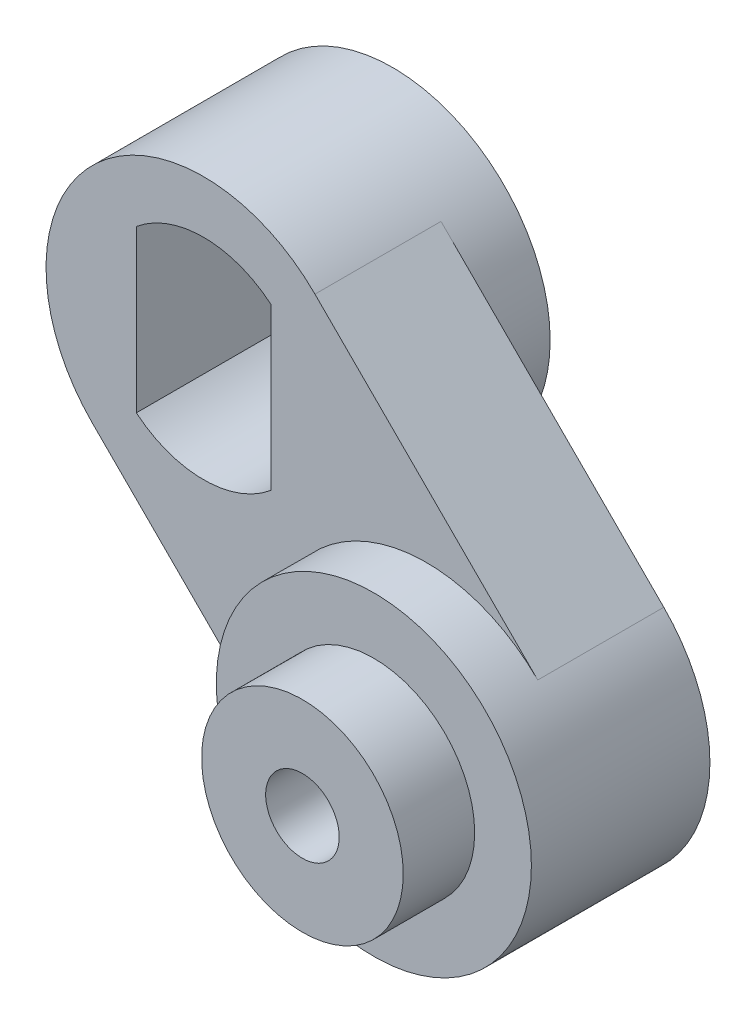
from build123d import *

# Parameters (mm, degrees)
ESQUISSE1_R             = 7.5
BOSS_EXTRU_1_DEPTH      = 9
BOSS_EXTRU_2_START      = -6
BOSS_EXTRU_2_DEPTH      = 6
ESQUISSE3_R             = 7.5
BOSS_EXTRU_3_DEPTH      = 2.5
ESQUISSE4_R             = 4.8
BOSS_EXTRU_4_DEPTH      = 3.4
ESQUISSE5_R             = 1.75
ENL_V_MAT_EXTRU_1_DEPTH = 19.4


with BuildPart() as part:
    # Esquisse1 → Boss.-Extru.1 (new body)
    with BuildSketch(Plane.XY):
        Circle(ESQUISSE1_R)
        with BuildLine():
            Line((-3.2, 0), (-3.2, 3.841874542))
            ThreePointArc((-3.2, 3.841874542), (0, 5), (3.2, 3.841874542))
            Line((3.2, 3.841874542), (3.2, 0))
            Line((3.2, 0), (3.2, -3.841874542))
            ThreePointArc((3.2, -3.841874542), (0, -5), (-3.2, -3.841874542))
            Line((-3.2, -3.841874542), (-3.2, 0))
        make_face(mode=Mode.SUBTRACT)
    extrude(amount=BOSS_EXTRU_1_DEPTH)

    # Esquisse2 → Boss.-Extru.2 (add)
    with BuildSketch(Plane.XY.offset(9).offset(BOSS_EXTRU_2_START)):
        with BuildLine():
            ThreePointArc((7.5, 0), (6.929096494, -2.870125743), (5.303300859, -5.303300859))
            ThreePointArc((5.303300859, -5.303300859), (0, -7.5), (-5.303300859, -5.303300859))
            Line((-5.303300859, -5.303300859), (5.303300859, -15.909902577))
            ThreePointArc((5.303300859, -15.909902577), (15.909902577, -15.909902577), (15.909902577, -5.303300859))
            Line((15.909902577, -5.303300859), (5.303300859, 5.303300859))
            ThreePointArc((5.303300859, 5.303300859), (6.929096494, 2.870125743), (7.5, 0))
        make_face()
    extrude(amount=BOSS_EXTRU_2_DEPTH)

    # Esquisse3 → Boss.-Extru.3 (add)
    with BuildSketch(Plane.XY.offset(9)):
        with Locations((10.606601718, -10.606601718)):
            Circle(ESQUISSE3_R)
    extrude(amount=BOSS_EXTRU_3_DEPTH)

    # Esquisse4 → Boss.-Extru.4 (add)
    with BuildSketch(Plane.XY.offset(11.5)):
        with Locations((10.606601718, -10.606601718)):
            Circle(ESQUISSE4_R)
    extrude(amount=BOSS_EXTRU_4_DEPTH)

    # Esquisse5 → Enl_v. mat.-Extru.1 (cut)
    with BuildSketch(Plane.XY.offset(14.9)):
        with Locations((10.606601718, -10.606601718)):
            Circle(ESQUISSE5_R)
    extrude(amount=-ENL_V_MAT_EXTRU_1_DEPTH, mode=Mode.SUBTRACT)


solid = part.part
